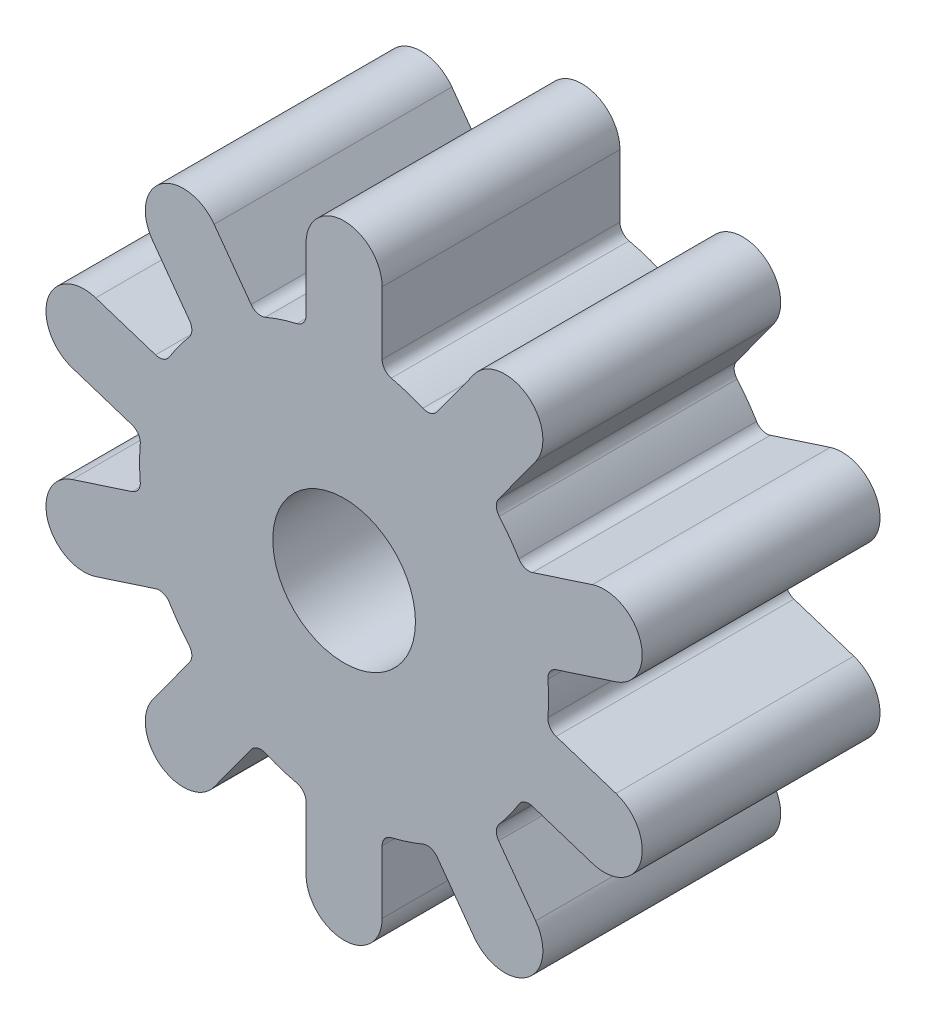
from build123d import *

# Parameters (mm, degrees)
BOSS_EXTRUDE1_DEPTH = 10
SKETCH2_R           = 3
CUT_EXTRUDE1_DEPTH  = 10


with BuildPart() as part:
    # Sketch1 → Boss-Extrude1 (new body)
    with BuildSketch(Plane.XY):
        with BuildLine():
            Line((-1.6, 11.5), (-1.6, 8.854377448))
            ThreePointArc((-1.6, 8.854377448), (-1.70776773, 8.544290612), (-1.984615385, 8.367873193))
            ThreePointArc((-1.984615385, 8.367873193), (-2.657546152, 8.17908604), (-3.312924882, 7.936279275))
            ThreePointArc((-3.312924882, 7.936279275), (-3.640594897, 7.916276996), (-3.910045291, 8.103798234))
            Line((-3.910045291, 8.103798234), (-5.46510321, 10.244151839))
            ThreePointArc((-5.46510321, 10.244151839), (-7.699986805, 10.598122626), (-8.053957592, 8.363239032))
            Line((-8.053957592, 8.363239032), (-6.498899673, 6.222885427))
            ThreePointArc((-6.498899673, 6.222885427), (-6.403821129, 5.908675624), (-6.524100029, 5.603223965))
            ThreePointArc((-6.524100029, 5.603223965), (-6.957546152, 5.05495317), (-7.345040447, 4.473296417))
            ThreePointArc((-7.345040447, 4.473296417), (-7.598374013, 4.264514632), (-7.926586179, 4.257843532))
            Line((-7.926586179, 4.257843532), (-10.442722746, 5.075385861))
            ThreePointArc((-10.442722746, 5.075385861), (-12.458840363, 4.048122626), (-11.431577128, 2.032005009))
            Line((-11.431577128, 2.032005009), (-8.915440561, 1.21446268))
            ThreePointArc((-8.915440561, 1.21446268), (-8.653832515, 1.016147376), (-8.571600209, 0.69833363))
            ThreePointArc((-8.571600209, 0.69833363), (-8.6, 0), (-8.571600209, -0.69833363))
            ThreePointArc((-8.571600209, -0.69833363), (-8.653832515, -1.016147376), (-8.915440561, -1.21446268))
            Line((-8.915440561, -1.21446268), (-11.431577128, -2.032005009))
            ThreePointArc((-11.431577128, -2.032005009), (-12.458840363, -4.048122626), (-10.442722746, -5.075385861))
            Line((-10.442722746, -5.075385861), (-7.926586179, -4.257843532))
            ThreePointArc((-7.926586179, -4.257843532), (-7.598374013, -4.264514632), (-7.345040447, -4.473296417))
            ThreePointArc((-7.345040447, -4.473296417), (-6.957546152, -5.05495317), (-6.524100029, -5.603223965))
            ThreePointArc((-6.524100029, -5.603223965), (-6.403821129, -5.908675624), (-6.498899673, -6.222885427))
            Line((-6.498899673, -6.222885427), (-8.053957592, -8.363239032))
            ThreePointArc((-8.053957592, -8.363239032), (-7.699986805, -10.598122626), (-5.46510321, -10.244151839))
            Line((-5.46510321, -10.244151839), (-3.910045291, -8.103798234))
            ThreePointArc((-3.910045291, -8.103798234), (-3.640594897, -7.916276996), (-3.312924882, -7.936279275))
            ThreePointArc((-3.312924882, -7.936279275), (-2.657546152, -8.17908604), (-1.984615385, -8.367873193))
            ThreePointArc((-1.984615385, -8.367873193), (-1.70776773, -8.544290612), (-1.6, -8.854377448))
            Line((-1.6, -8.854377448), (-1.6, -11.5))
            ThreePointArc((-1.6, -11.5), (0, -13.1), (1.6, -11.5))
            Line((1.6, -11.5), (1.6, -8.854377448))
            ThreePointArc((1.6, -8.854377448), (1.70776773, -8.544290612), (1.984615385, -8.367873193))
            ThreePointArc((1.984615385, -8.367873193), (2.657546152, -8.17908604), (3.312924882, -7.936279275))
            ThreePointArc((3.312924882, -7.936279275), (3.640594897, -7.916276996), (3.910045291, -8.103798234))
            Line((3.910045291, -8.103798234), (5.46510321, -10.244151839))
            ThreePointArc((5.46510321, -10.244151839), (7.699986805, -10.598122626), (8.053957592, -8.363239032))
            Line((8.053957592, -8.363239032), (6.498899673, -6.222885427))
            ThreePointArc((6.498899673, -6.222885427), (6.403821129, -5.908675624), (6.524100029, -5.603223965))
            ThreePointArc((6.524100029, -5.603223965), (6.957546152, -5.05495317), (7.345040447, -4.473296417))
            ThreePointArc((7.345040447, -4.473296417), (7.598374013, -4.264514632), (7.926586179, -4.257843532))
            Line((7.926586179, -4.257843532), (10.442722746, -5.075385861))
            ThreePointArc((10.442722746, -5.075385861), (12.458840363, -4.048122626), (11.431577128, -2.032005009))
            Line((11.431577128, -2.032005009), (8.915440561, -1.21446268))
            ThreePointArc((8.915440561, -1.21446268), (8.653832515, -1.016147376), (8.571600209, -0.69833363))
            ThreePointArc((8.571600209, -0.69833363), (8.6, 0), (8.571600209, 0.69833363))
            ThreePointArc((8.571600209, 0.69833363), (8.653832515, 1.016147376), (8.915440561, 1.21446268))
            Line((8.915440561, 1.21446268), (11.431577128, 2.032005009))
            ThreePointArc((11.431577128, 2.032005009), (12.458840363, 4.048122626), (10.442722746, 5.075385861))
            Line((10.442722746, 5.075385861), (7.926586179, 4.257843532))
            ThreePointArc((7.926586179, 4.257843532), (7.598374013, 4.264514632), (7.345040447, 4.473296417))
            ThreePointArc((7.345040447, 4.473296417), (6.957546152, 5.05495317), (6.524100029, 5.603223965))
            ThreePointArc((6.524100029, 5.603223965), (6.403821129, 5.908675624), (6.498899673, 6.222885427))
            Line((6.498899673, 6.222885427), (8.053957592, 8.363239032))
            ThreePointArc((8.053957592, 8.363239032), (7.699986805, 10.598122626), (5.46510321, 10.244151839))
            Line((5.46510321, 10.244151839), (3.910045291, 8.103798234))
            ThreePointArc((3.910045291, 8.103798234), (3.640594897, 7.916276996), (3.312924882, 7.936279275))
            ThreePointArc((3.312924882, 7.936279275), (2.657546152, 8.17908604), (1.984615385, 8.367873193))
            ThreePointArc((1.984615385, 8.367873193), (1.70776773, 8.544290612), (1.6, 8.854377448))
            Line((1.6, 8.854377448), (1.6, 11.5))
            ThreePointArc((1.6, 11.5), (0, 13.1), (-1.6, 11.5))
        make_face()
    extrude(amount=BOSS_EXTRUDE1_DEPTH)

    # Sketch2 → Cut-Extrude1 (cut)
    with BuildSketch(Plane.XY.offset(10)):
        Circle(SKETCH2_R)
    extrude(amount=-CUT_EXTRUDE1_DEPTH, mode=Mode.SUBTRACT)


solid = part.part
